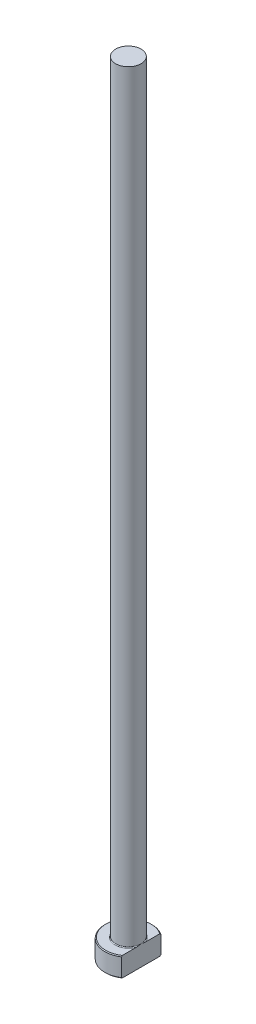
from build123d import *
from build123d.topology import SkipClean

# Parameters (mm, degrees)
CHAMFER1_SIZE = 0.2
FILLET1_R     = 0.2
KEY_DEPTH     = 201.179919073


with BuildPart() as part:
    # Sketch1 → Revolve1 (revolve)
    with BuildSketch(Plane.XY, mode=Mode.PRIVATE) as revolve1_sk:
        Polygon((0, 0), (-6, 0), (-6, 5), (-3.25, 5), (-3.25, 200), (0, 200), align=None)
    revolve(revolve1_sk.sketch.rotate(Axis((0, 259.958771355, 0), (0, -1, 0)), 270), axis=Axis((0, 259.958771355, 0), (0, -1, 0)))

    # Chamfer1
    chamfer1_edges = [part.edges().sort_by_distance(p)[0] for p in [
        (0, 5, -6),
        (0, 0, -6),
    ]]
    chamfer(chamfer1_edges, length=CHAMFER1_SIZE)

    # Fillet1
    fillet1_edges = [part.edges().sort_by_distance(p)[0] for p in [
        (0, 5, -3.25),
    ]]
    fillet(fillet1_edges, radius=FILLET1_R)

    # Sketch2 → KEY (cut, through all)
    with SkipClean():  # the faces are left unmerged after this step: merging them gives an invalid solid
        with BuildSketch(Plane(origin=(0, 0, 0), x_dir=(1, 0, 0), z_dir=(0, 1, 0))):
            with BuildLine():
                Line((3.25, 5.04356025), (3.25, -5.04356025))
                ThreePointArc((3.25, -5.04356025), (6, 0), (3.25, 5.04356025))
            make_face()
        extrude(amount=KEY_DEPTH, mode=Mode.SUBTRACT)


solid = part.part
